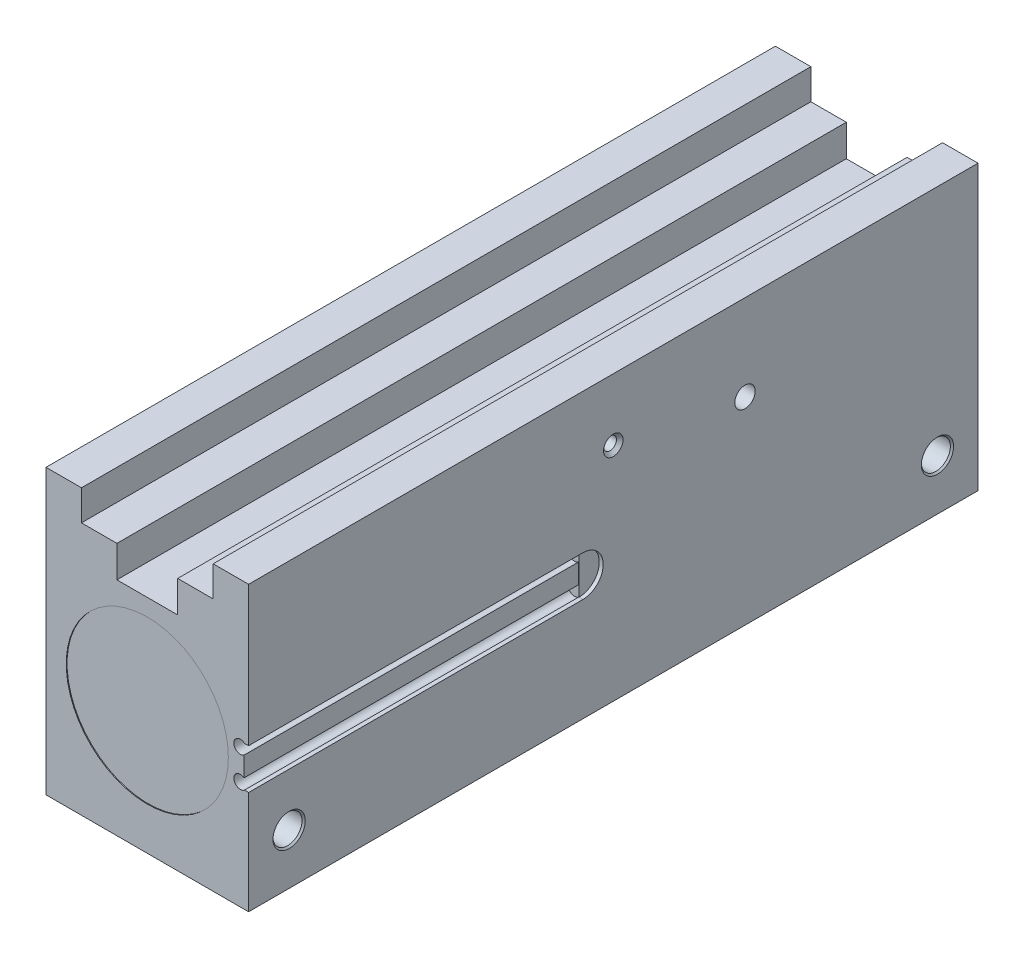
from build123d import *

# Parameters (mm, degrees)
SKETCH1_W                              = 63.5
SKETCH1_H                              = 88.9
BOSS_EXTRUDE1_DEPTH                    = 228.6
CUT_EXTRUDE1_DEPTH                     = 254.364204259
SKETCH3_R                              = 3.2004
CUT_EXTRUDE2_DEPTH                     = 6.35
F_1_4_20_TAPPED_HOLE1_D                = 5.1054
F_1_4_20_TAPPED_HOLE1_DEPTH            = 11.43
F_1_4_20_TAPPED_HOLE1_CSINK_D          = 7.62
F_1_4_20_TAPPED_HOLE1_CSINK_ANGLE      = 90
F_1_4_20_TAPPED_HOLE1_TIP              = 1.533816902
CUT_EXTRUDE4_DEPTH                     = 104.775
SKETCH10_R                             = 6.35
CUT_EXTRUDE5_DEPTH                     = 1.2319
F_1_8_27_NPSM_TAPPED_HOLE2_D           = 9.0932
F_1_8_27_NPSM_TAPPED_HOLE2_DEPTH       = 22.86
F_1_8_27_NPSM_TAPPED_HOLE2_CSINK_D     = 10.1092
F_1_8_27_NPSM_TAPPED_HOLE2_CSINK_ANGLE = 90
F_1_8_27_NPSM_TAPPED_HOLE2_TIP         = 2.73187289
SKETCH16_R                             = 3.19405
CUT_EXTRUDE7_DEPTH                     = 11.0998
F_10_32_TAPPED_HOLE2_D                 = 4.0386
F_10_32_TAPPED_HOLE2_DEPTH             = 11.938
F_10_32_TAPPED_HOLE2_CSINK_D           = 6.096
F_10_32_TAPPED_HOLE2_CSINK_ANGLE       = 90
F_10_32_TAPPED_HOLE2_TIP               = 1.213317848
SKETCH19_R                             = 25.4
CUT_EXTRUDE8_DEPTH                     = 0.254
F_1_8_27_NPSM_TAPPED_HOLE3_D           = 9.0932
F_1_8_27_NPSM_TAPPED_HOLE3_DEPTH       = 22.86
F_1_8_27_NPSM_TAPPED_HOLE3_CSINK_D     = 10.1092
F_1_8_27_NPSM_TAPPED_HOLE3_CSINK_ANGLE = 90
F_1_8_27_NPSM_TAPPED_HOLE3_TIP         = 2.73187289


with BuildPart() as part:
    # Sketch1 → Boss-Extrude1 (new body)
    with BuildSketch(Plane.XY):
        with Locations((31.75, 44.45)):
            Rectangle(SKETCH1_W, SKETCH1_H)
    extrude(amount=-BOSS_EXTRUDE1_DEPTH)

    # Sketch2 → Cut-Extrude1 (cut, through all)
    with BuildSketch(Plane.XY):
        Polygon((11.1125, 88.9), (52.3875, 88.9), (52.3875, 79.375), (41.275, 79.375), (41.275, 69.469), (22.225, 69.469), (22.225, 79.375), (11.1125, 79.375), align=None)
    extrude(amount=-CUT_EXTRUDE1_DEPTH, mode=Mode.SUBTRACT)

    # Sketch3 → Cut-Extrude2 (cut)
    with BuildSketch(Plane.XZ):
        with Locations(Location((31.75, -38.1, 0), (0, 0, 270))):
            Circle(SKETCH3_R)
        with Locations(Location((9.525, -114.3, 0), (0, 0, 270))):
            Circle(SKETCH3_R)
        with Locations(Location((53.975, -114.3, 0), (0, 0, 270))):
            Circle(SKETCH3_R)
        with Locations(Location((31.75, -190.5, 0), (0, 0, 270))):
            Circle(SKETCH3_R)
    extrude(amount=-CUT_EXTRUDE2_DEPTH, mode=Mode.SUBTRACT)

    # 1_4-20 Tapped Hole1
    with Locations(Plane(origin=(0, 0, 0), x_dir=(-1, 0, 0), z_dir=(0, -1, 0))):
        with Locations((-9.525, 88.9), (-53.975, 88.9), (-53.974972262, 139.7), (-9.525, 139.650342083)):
            CounterSinkHole(F_1_4_20_TAPPED_HOLE1_D / 2, F_1_4_20_TAPPED_HOLE1_CSINK_D / 2, depth=F_1_4_20_TAPPED_HOLE1_DEPTH, counter_sink_angle=F_1_4_20_TAPPED_HOLE1_CSINK_ANGLE)
            with Locations((0, 0, -(F_1_4_20_TAPPED_HOLE1_DEPTH + F_1_4_20_TAPPED_HOLE1_TIP / 2))):  # 118° drill point
                Cone(0, F_1_4_20_TAPPED_HOLE1_D / 2, F_1_4_20_TAPPED_HOLE1_TIP, mode=Mode.SUBTRACT)

    # Sketch9 → Cut-Extrude4 (cut)
    with BuildSketch(Plane.XY):
        with BuildLine():
            Line((62.197858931, 45.085), (63.5, 45.085))
            Line((63.5, 45.085), (63.5, 32.385))
            Line((63.5, 32.385), (62.197858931, 32.385))
            ThreePointArc((62.197858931, 32.385), (58.86588515, 33.897250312), (62.0776, 35.650486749))
            Line((62.0776, 35.650486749), (62.0776, 41.819513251))
            ThreePointArc((62.0776, 41.819513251), (58.86588515, 43.572749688), (62.197858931, 45.085))
        make_face()
    extrude(amount=-CUT_EXTRUDE4_DEPTH, mode=Mode.SUBTRACT)

    # Sketch10 → Cut-Extrude5 (cut)
    with BuildSketch(Plane(origin=(63.5, 0, 0), x_dir=(0, 0, -1), z_dir=(1, 0, 0))):
        with Locations((104.775, 38.735)):
            Circle(SKETCH10_R)
    extrude(amount=-CUT_EXTRUDE5_DEPTH, mode=Mode.SUBTRACT)

    # 1_8-27 NPSM Tapped Hole2
    with Locations(Plane(origin=(63.5, 0, 0), x_dir=(0, 0, -1), z_dir=(1, 0, 0))):
        with Locations((12.7, 15.875), (215.9, 15.875)):
            CounterSinkHole(F_1_8_27_NPSM_TAPPED_HOLE2_D / 2, F_1_8_27_NPSM_TAPPED_HOLE2_CSINK_D / 2, depth=F_1_8_27_NPSM_TAPPED_HOLE2_DEPTH, counter_sink_angle=F_1_8_27_NPSM_TAPPED_HOLE2_CSINK_ANGLE)
            with Locations((0, 0, -(F_1_8_27_NPSM_TAPPED_HOLE2_DEPTH + F_1_8_27_NPSM_TAPPED_HOLE2_TIP / 2))):  # 118° drill point
                Cone(0, F_1_8_27_NPSM_TAPPED_HOLE2_D / 2, F_1_8_27_NPSM_TAPPED_HOLE2_TIP, mode=Mode.SUBTRACT)

    # Sketch16 → Cut-Extrude7 (cut)
    with BuildSketch(Plane(origin=(63.5, 0, 0), x_dir=(0, 0, -1), z_dir=(1, 0, 0))):
        with Locations((155.575, 61.976)):
            Circle(SKETCH16_R)
    extrude(amount=-CUT_EXTRUDE7_DEPTH, mode=Mode.SUBTRACT)

    # 10-32 Tapped Hole2
    with Locations(Plane(origin=(63.5, 0, 0), x_dir=(0, 0, -1), z_dir=(1, 0, 0))):
        with Locations((114.3, 69.469)):
            CounterSinkHole(F_10_32_TAPPED_HOLE2_D / 2, F_10_32_TAPPED_HOLE2_CSINK_D / 2, depth=F_10_32_TAPPED_HOLE2_DEPTH, counter_sink_angle=F_10_32_TAPPED_HOLE2_CSINK_ANGLE)
            with Locations((0, 0, -(F_10_32_TAPPED_HOLE2_DEPTH + F_10_32_TAPPED_HOLE2_TIP / 2))):  # 118° drill point
                Cone(0, F_10_32_TAPPED_HOLE2_D / 2, F_10_32_TAPPED_HOLE2_TIP, mode=Mode.SUBTRACT)

    # Sketch19 → Cut-Extrude8 (cut)
    with BuildSketch(Plane.XY):
        with Locations((31.75, 38.735)):
            Circle(SKETCH19_R)
    extrude(amount=-CUT_EXTRUDE8_DEPTH, mode=Mode.SUBTRACT)

    # 1_8-27 NPSM Tapped Hole3
    with Locations(Plane(origin=(0, 0, 0), x_dir=(-1, 0, 0), z_dir=(0, -1, 0))):
        with Locations((-31.75, 12.7), (-31.75, 215.9)):
            CounterSinkHole(F_1_8_27_NPSM_TAPPED_HOLE3_D / 2, F_1_8_27_NPSM_TAPPED_HOLE3_CSINK_D / 2, depth=F_1_8_27_NPSM_TAPPED_HOLE3_DEPTH, counter_sink_angle=F_1_8_27_NPSM_TAPPED_HOLE3_CSINK_ANGLE)
            with Locations((0, 0, -(F_1_8_27_NPSM_TAPPED_HOLE3_DEPTH + F_1_8_27_NPSM_TAPPED_HOLE3_TIP / 2))):  # 118° drill point
                Cone(0, F_1_8_27_NPSM_TAPPED_HOLE3_D / 2, F_1_8_27_NPSM_TAPPED_HOLE3_TIP, mode=Mode.SUBTRACT)


solid = part.part
